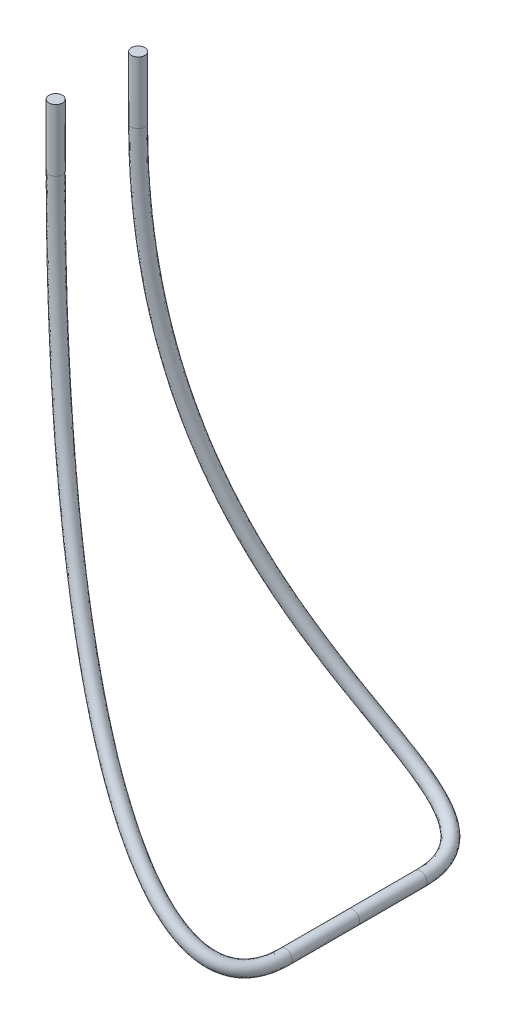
from build123d import *

# Parameters (mm, degrees)
SKETCH2_R = 0.635


with BuildPart() as part:
    # Sweep1: sweep along a curve in space
    with BuildLine() as sweep1_path:
        Line((-24.13, 264.958160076, 3.884578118), (-24.13, 259.101435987, 3.884578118))
        add(Edge.make_bspline(
            [(-24.13, 259.101435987, 3.884578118), (-24.13, 217.07758121, 3.884578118), (0, 208.28, 20.025411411), (0, 208.28, 6.35)],
            knots=[0, 0, 0, 0, 1, 1, 1, 1], degree=3))
        Line((0, 208.28, 6.35), (0, 208.28, 0))
    # Sketch2 → Sweep1 (sweep)
    with BuildSketch(Plane.XY):
        with Locations((0, 208.28)):
            Circle(SKETCH2_R)
    sweep(path=sweep1_path.line)


with BuildPart() as body_2:
    # Mirror1: mirrored copy
    add(part.part.mirror(Plane.XY))


solid = Compound([part.part, body_2.part])
